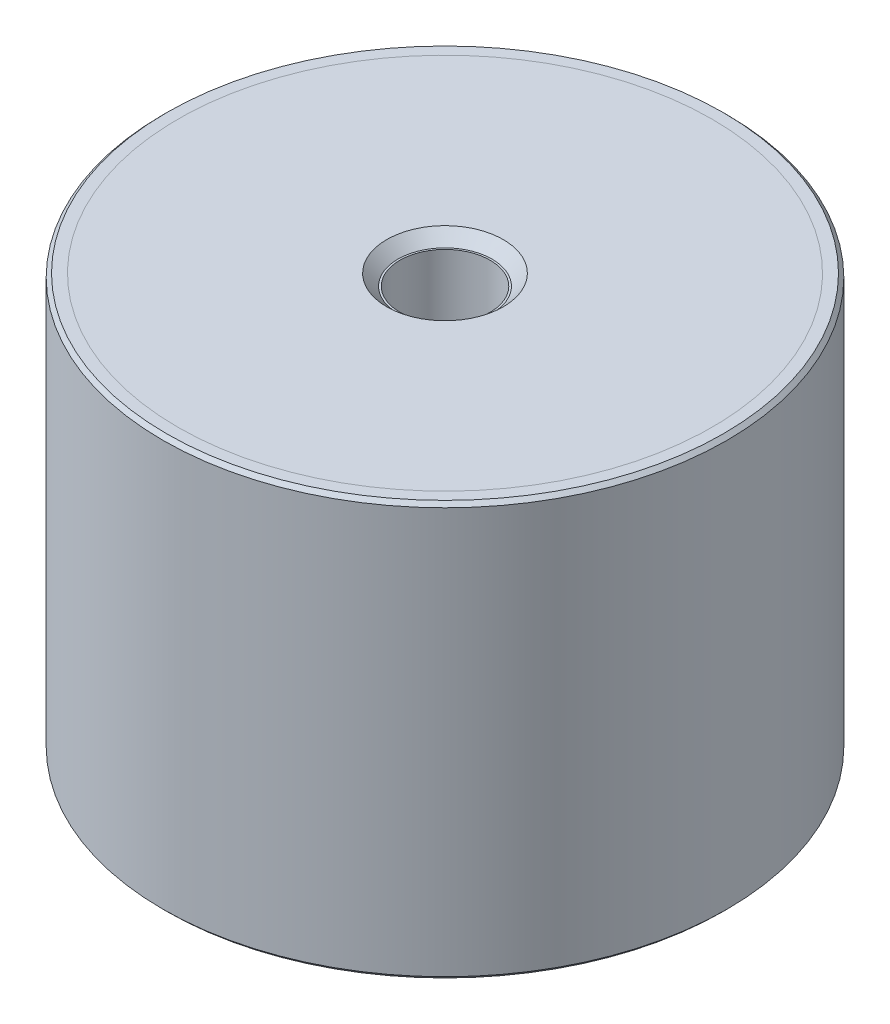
ISO-10303-21;
HEADER;
FILE_DESCRIPTION(('STEP AP214'),'2;1');
FILE_NAME('part.step','',(''),(''),'','','');
FILE_SCHEMA(('AUTOMOTIVE_DESIGN { 1 0 10303 214 1 1 1 1 }'));
ENDSEC;
DATA;
#1=APPLICATION_CONTEXT('core data for automotive mechanical design processes');
#2=APPLICATION_PROTOCOL_DEFINITION('international standard','automotive_design',2000,#1);
#3=PRODUCT_CONTEXT('',#1,'mechanical');
#4=PRODUCT('Part','Part','',(#3));
#5=PRODUCT_RELATED_PRODUCT_CATEGORY('part','',(#4));
#6=PRODUCT_DEFINITION_FORMATION('','',#4);
#7=PRODUCT_DEFINITION_CONTEXT('part definition',#1,'design');
#8=PRODUCT_DEFINITION('design','',#6,#7);
#9=PRODUCT_DEFINITION_SHAPE('','',#8);
#10=(LENGTH_UNIT() NAMED_UNIT(*) SI_UNIT(.MILLI.,.METRE.));
#11=(NAMED_UNIT(*) PLANE_ANGLE_UNIT() SI_UNIT($,.RADIAN.));
#12=(NAMED_UNIT(*) SI_UNIT($,.STERADIAN.) SOLID_ANGLE_UNIT());
#13=UNCERTAINTY_MEASURE_WITH_UNIT(LENGTH_MEASURE(1.E-05),#10,'distance_accuracy_value','');
#14=(GEOMETRIC_REPRESENTATION_CONTEXT(3) GLOBAL_UNCERTAINTY_ASSIGNED_CONTEXT((#13)) GLOBAL_UNIT_ASSIGNED_CONTEXT((#10,
#11,#12)) REPRESENTATION_CONTEXT('',''));
#15=CARTESIAN_POINT('',(0.,0.,0.));
#16=DIRECTION('',(0.,0.,1.));
#17=DIRECTION('',(1.,0.,0.));
#18=AXIS2_PLACEMENT_3D('',#15,#16,#17);
#19=CARTESIAN_POINT('',(0.,-52.,6.));
#20=DIRECTION('',(0.,1.,0.));
#21=DIRECTION('',(0.,0.,1.));
#22=AXIS2_PLACEMENT_3D('',#19,#20,#21);
#23=PLANE('',#22);
#24=CARTESIAN_POINT('',(0.,-52.,0.));
#25=DIRECTION('',(0.,1.,0.));
#26=DIRECTION('',(0.,0.,1.));
#27=AXIS2_PLACEMENT_3D('',#24,#25,#26);
#28=CIRCLE('',#27,6.25000000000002);
#29=CARTESIAN_POINT('',(0.,-52.,6.25000000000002));
#30=VERTEX_POINT('',#29);
#31=EDGE_CURVE('P0_E10',#30,#30,#28,.F.);
#32=ORIENTED_EDGE('',*,*,#31,.T.);
#33=EDGE_LOOP('',(#32));
#34=FACE_BOUND('',#33,.T.);
#35=CARTESIAN_POINT('',(0.,-52.,0.));
#36=DIRECTION('',(0.,1.,0.));
#37=DIRECTION('',(0.,0.,1.));
#38=AXIS2_PLACEMENT_3D('',#35,#36,#37);
#39=CIRCLE('',#38,35.5);
#40=CARTESIAN_POINT('',(0.,-52.,35.5));
#41=VERTEX_POINT('',#40);
#42=EDGE_CURVE('P0_E25',#41,#41,#39,.T.);
#43=ORIENTED_EDGE('',*,*,#42,.T.);
#44=EDGE_LOOP('',(#43));
#45=FACE_BOUND('',#44,.T.);
#46=ADVANCED_FACE('P0_F14',(#34,#45),#23,.T.);
#47=CARTESIAN_POINT('',(0.,16.0340428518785,0.));
#48=DIRECTION('',(0.,1.,0.));
#49=DIRECTION('',(0.,0.,1.));
#50=AXIS2_PLACEMENT_3D('',#47,#48,#49);
#51=CYLINDRICAL_SURFACE('',#50,35.5);
#52=CARTESIAN_POINT('',(0.,-53.5,0.));
#53=DIRECTION('',(0.,1.,0.));
#54=DIRECTION('',(0.,0.,1.));
#55=AXIS2_PLACEMENT_3D('',#52,#53,#54);
#56=CIRCLE('',#55,35.5);
#57=CARTESIAN_POINT('',(0.,-53.5,35.5));
#58=VERTEX_POINT('',#57);
#59=EDGE_CURVE('P0_E29',#58,#58,#56,.T.);
#60=ORIENTED_EDGE('',*,*,#59,.T.);
#61=EDGE_LOOP('',(#60));
#62=FACE_BOUND('',#61,.T.);
#63=ORIENTED_EDGE('',*,*,#42,.F.);
#64=EDGE_LOOP('',(#63));
#65=FACE_BOUND('',#64,.T.);
#66=ADVANCED_FACE('P0_F35',(#62,#65),#51,.T.);
#67=CARTESIAN_POINT('',(0.,-53.5,35.5));
#68=DIRECTION('',(0.,-1.,0.));
#69=DIRECTION('',(0.,0.,-1.));
#70=AXIS2_PLACEMENT_3D('',#67,#68,#69);
#71=PLANE('',#70);
#72=CARTESIAN_POINT('',(0.,-53.5,0.));
#73=DIRECTION('',(0.,-1.,0.));
#74=DIRECTION('',(0.,0.,-1.));
#75=AXIS2_PLACEMENT_3D('',#72,#73,#74);
#76=CIRCLE('',#75,7.75000000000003);
#77=CARTESIAN_POINT('',(0.,-53.5,-7.75000000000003));
#78=VERTEX_POINT('',#77);
#79=EDGE_CURVE('P0_E21',#78,#78,#76,.F.);
#80=ORIENTED_EDGE('',*,*,#79,.T.);
#81=EDGE_LOOP('',(#80));
#82=FACE_BOUND('',#81,.T.);
#83=ORIENTED_EDGE('',*,*,#59,.F.);
#84=EDGE_LOOP('',(#83));
#85=FACE_BOUND('',#84,.T.);
#86=ADVANCED_FACE('P0_F38',(#82,#85),#71,.T.);
#87=CARTESIAN_POINT('',(0.,-53.5,0.));
#88=DIRECTION('',(0.,-1.,0.));
#89=DIRECTION('',(0.,0.,-1.));
#90=AXIS2_PLACEMENT_3D('',#87,#88,#89);
#91=CONICAL_SURFACE('',#90,7.75000000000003,0.785398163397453);
#92=ORIENTED_EDGE('',*,*,#31,.F.);
#93=EDGE_LOOP('',(#92));
#94=FACE_BOUND('',#93,.T.);
#95=ORIENTED_EDGE('',*,*,#79,.F.);
#96=EDGE_LOOP('',(#95));
#97=FACE_BOUND('',#96,.T.);
#98=ADVANCED_FACE('P0_F16',(#94,#97),#91,.F.);
#99=CLOSED_SHELL('',(#46,#66,#86,#98));
#100=MANIFOLD_SOLID_BREP('P0_B1',#99);
#101=CARTESIAN_POINT('',(0.,1.5,6.));
#102=DIRECTION('',(0.,1.,0.));
#103=DIRECTION('',(0.,0.,1.));
#104=AXIS2_PLACEMENT_3D('',#101,#102,#103);
#105=PLANE('',#104);
#106=CARTESIAN_POINT('',(0.,1.5,0.));
#107=DIRECTION('',(0.,1.,0.));
#108=DIRECTION('',(0.,0.,1.));
#109=AXIS2_PLACEMENT_3D('',#106,#107,#108);
#110=CIRCLE('',#109,7.75000000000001);
#111=CARTESIAN_POINT('',(0.,1.5,7.75000000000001));
#112=VERTEX_POINT('',#111);
#113=EDGE_CURVE('P1_E10',#112,#112,#110,.F.);
#114=ORIENTED_EDGE('',*,*,#113,.T.);
#115=EDGE_LOOP('',(#114));
#116=FACE_BOUND('',#115,.T.);
#117=CARTESIAN_POINT('',(0.,1.5,0.));
#118=DIRECTION('',(0.,1.,0.));
#119=DIRECTION('',(0.,0.,1.));
#120=AXIS2_PLACEMENT_3D('',#117,#118,#119);
#121=CIRCLE('',#120,35.5);
#122=CARTESIAN_POINT('',(0.,1.5,35.5));
#123=VERTEX_POINT('',#122);
#124=EDGE_CURVE('P1_E25',#123,#123,#121,.T.);
#125=ORIENTED_EDGE('',*,*,#124,.T.);
#126=EDGE_LOOP('',(#125));
#127=FACE_BOUND('',#126,.T.);
#128=ADVANCED_FACE('P1_F14',(#116,#127),#105,.T.);
#129=CARTESIAN_POINT('',(0.,69.5340428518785,0.));
#130=DIRECTION('',(0.,1.,0.));
#131=DIRECTION('',(0.,0.,1.));
#132=AXIS2_PLACEMENT_3D('',#129,#130,#131);
#133=CYLINDRICAL_SURFACE('',#132,35.5);
#134=CARTESIAN_POINT('',(0.,0.,0.));
#135=DIRECTION('',(0.,1.,0.));
#136=DIRECTION('',(0.,0.,1.));
#137=AXIS2_PLACEMENT_3D('',#134,#135,#136);
#138=CIRCLE('',#137,35.5);
#139=CARTESIAN_POINT('',(0.,0.,35.5));
#140=VERTEX_POINT('',#139);
#141=EDGE_CURVE('P1_E29',#140,#140,#138,.T.);
#142=ORIENTED_EDGE('',*,*,#141,.T.);
#143=EDGE_LOOP('',(#142));
#144=FACE_BOUND('',#143,.T.);
#145=ORIENTED_EDGE('',*,*,#124,.F.);
#146=EDGE_LOOP('',(#145));
#147=FACE_BOUND('',#146,.T.);
#148=ADVANCED_FACE('P1_F35',(#144,#147),#133,.T.);
#149=CARTESIAN_POINT('',(0.,0.,35.5));
#150=DIRECTION('',(0.,-1.,0.));
#151=DIRECTION('',(0.,0.,-1.));
#152=AXIS2_PLACEMENT_3D('',#149,#150,#151);
#153=PLANE('',#152);
#154=CARTESIAN_POINT('',(0.,0.,0.));
#155=DIRECTION('',(0.,-1.,0.));
#156=DIRECTION('',(0.,0.,-1.));
#157=AXIS2_PLACEMENT_3D('',#154,#155,#156);
#158=CIRCLE('',#157,6.25000000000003);
#159=CARTESIAN_POINT('',(0.,0.,-6.25000000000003));
#160=VERTEX_POINT('',#159);
#161=EDGE_CURVE('P1_E21',#160,#160,#158,.F.);
#162=ORIENTED_EDGE('',*,*,#161,.T.);
#163=EDGE_LOOP('',(#162));
#164=FACE_BOUND('',#163,.T.);
#165=ORIENTED_EDGE('',*,*,#141,.F.);
#166=EDGE_LOOP('',(#165));
#167=FACE_BOUND('',#166,.T.);
#168=ADVANCED_FACE('P1_F38',(#164,#167),#153,.T.);
#169=CARTESIAN_POINT('',(0.,-0.250000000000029,0.));
#170=DIRECTION('',(0.,1.,0.));
#171=DIRECTION('',(0.,0.,1.));
#172=AXIS2_PLACEMENT_3D('',#169,#170,#171);
#173=CONICAL_SURFACE('',#172,6.,0.785398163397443);
#174=ORIENTED_EDGE('',*,*,#113,.F.);
#175=EDGE_LOOP('',(#174));
#176=FACE_BOUND('',#175,.T.);
#177=ORIENTED_EDGE('',*,*,#161,.F.);
#178=EDGE_LOOP('',(#177));
#179=FACE_BOUND('',#178,.T.);
#180=ADVANCED_FACE('P1_F16',(#176,#179),#173,.F.);
#181=CLOSED_SHELL('',(#128,#148,#168,#180));
#182=MANIFOLD_SOLID_BREP('P1_B1',#181);
#183=CARTESIAN_POINT('',(0.,0.,0.));
#184=DIRECTION('',(0.,1.,0.));
#185=DIRECTION('',(0.,0.,1.));
#186=AXIS2_PLACEMENT_3D('',#183,#184,#185);
#187=PLANE('',#186);
#188=CARTESIAN_POINT('',(0.,0.,0.));
#189=DIRECTION('',(0.,1.,0.));
#190=DIRECTION('',(0.,0.,1.));
#191=AXIS2_PLACEMENT_3D('',#188,#189,#190);
#192=CIRCLE('',#191,6.);
#193=CARTESIAN_POINT('',(0.,0.,6.));
#194=VERTEX_POINT('',#193);
#195=EDGE_CURVE('P2_E46',#194,#194,#192,.T.);
#196=ORIENTED_EDGE('',*,*,#195,.F.);
#197=EDGE_LOOP('',(#196));
#198=FACE_BOUND('',#197,.T.);
#199=CARTESIAN_POINT('',(0.,0.,0.));
#200=DIRECTION('',(0.,1.,0.));
#201=DIRECTION('',(0.,0.,1.));
#202=AXIS2_PLACEMENT_3D('',#199,#200,#201);
#203=CIRCLE('',#202,35.5);
#204=CARTESIAN_POINT('',(0.,0.,35.5));
#205=VERTEX_POINT('',#204);
#206=EDGE_CURVE('P2_E33',#205,#205,#203,.T.);
#207=ORIENTED_EDGE('',*,*,#206,.T.);
#208=EDGE_LOOP('',(#207));
#209=FACE_BOUND('',#208,.T.);
#210=ADVANCED_FACE('P2_F13',(#198,#209),#187,.T.);
#211=CARTESIAN_POINT('',(0.,65.5134936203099,0.));
#212=DIRECTION('',(0.,1.,0.));
#213=DIRECTION('',(0.,0.,1.));
#214=AXIS2_PLACEMENT_3D('',#211,#212,#213);
#215=CYLINDRICAL_SURFACE('',#214,35.5);
#216=CARTESIAN_POINT('',(0.,1.5,0.));
#217=DIRECTION('',(0.,1.,0.));
#218=DIRECTION('',(0.,0.,1.));
#219=AXIS2_PLACEMENT_3D('',#216,#217,#218);
#220=CIRCLE('',#219,35.5);
#221=CARTESIAN_POINT('',(0.,1.5,35.5));
#222=VERTEX_POINT('',#221);
#223=EDGE_CURVE('P2_E36',#222,#222,#220,.T.);
#224=ORIENTED_EDGE('',*,*,#223,.T.);
#225=EDGE_LOOP('',(#224));
#226=FACE_BOUND('',#225,.T.);
#227=ORIENTED_EDGE('',*,*,#206,.F.);
#228=EDGE_LOOP('',(#227));
#229=FACE_BOUND('',#228,.T.);
#230=ADVANCED_FACE('P2_F92',(#226,#229),#215,.F.);
#231=CARTESIAN_POINT('',(0.,1.5,35.5));
#232=DIRECTION('',(0.,1.,0.));
#233=DIRECTION('',(0.,0.,1.));
#234=AXIS2_PLACEMENT_3D('',#231,#232,#233);
#235=PLANE('',#234);
#236=CARTESIAN_POINT('',(0.,1.5,0.));
#237=DIRECTION('',(0.,1.,0.));
#238=DIRECTION('',(0.,0.,1.));
#239=AXIS2_PLACEMENT_3D('',#236,#237,#238);
#240=CIRCLE('',#239,37.);
#241=CARTESIAN_POINT('',(0.,1.5,37.));
#242=VERTEX_POINT('',#241);
#243=EDGE_CURVE('P2_E9',#242,#242,#240,.T.);
#244=ORIENTED_EDGE('',*,*,#243,.T.);
#245=EDGE_LOOP('',(#244));
#246=FACE_BOUND('',#245,.T.);
#247=ORIENTED_EDGE('',*,*,#223,.F.);
#248=EDGE_LOOP('',(#247));
#249=FACE_BOUND('',#248,.T.);
#250=ADVANCED_FACE('P2_F88',(#246,#249),#235,.T.);
#251=CARTESIAN_POINT('',(0.,65.5134936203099,0.));
#252=DIRECTION('',(0.,1.,0.));
#253=DIRECTION('',(0.,0.,1.));
#254=AXIS2_PLACEMENT_3D('',#251,#252,#253);
#255=CYLINDRICAL_SURFACE('',#254,37.5);
#256=CARTESIAN_POINT('',(0.,-53.,0.));
#257=DIRECTION('',(0.,-1.,0.));
#258=DIRECTION('',(0.,0.,-1.));
#259=AXIS2_PLACEMENT_3D('',#256,#257,#258);
#260=CIRCLE('',#259,37.5);
#261=CARTESIAN_POINT('',(0.,-53.,-37.5));
#262=VERTEX_POINT('',#261);
#263=EDGE_CURVE('P2_E24',#262,#262,#260,.F.);
#264=ORIENTED_EDGE('',*,*,#263,.T.);
#265=EDGE_LOOP('',(#264));
#266=FACE_BOUND('',#265,.T.);
#267=CARTESIAN_POINT('',(0.,1.,0.));
#268=DIRECTION('',(0.,1.,0.));
#269=DIRECTION('',(0.,0.,1.));
#270=AXIS2_PLACEMENT_3D('',#267,#268,#269);
#271=CIRCLE('',#270,37.5);
#272=CARTESIAN_POINT('',(0.,1.,37.5));
#273=VERTEX_POINT('',#272);
#274=EDGE_CURVE('P2_E28',#273,#273,#271,.F.);
#275=ORIENTED_EDGE('',*,*,#274,.T.);
#276=EDGE_LOOP('',(#275));
#277=FACE_BOUND('',#276,.T.);
#278=ADVANCED_FACE('P2_F82',(#266,#277),#255,.T.);
#279=CARTESIAN_POINT('',(0.,-53.5,37.5));
#280=DIRECTION('',(0.,-1.,0.));
#281=DIRECTION('',(0.,0.,-1.));
#282=AXIS2_PLACEMENT_3D('',#279,#280,#281);
#283=PLANE('',#282);
#284=CARTESIAN_POINT('',(0.,-53.5,0.));
#285=DIRECTION('',(0.,-1.,0.));
#286=DIRECTION('',(0.,0.,-1.));
#287=AXIS2_PLACEMENT_3D('',#284,#285,#286);
#288=CIRCLE('',#287,37.);
#289=CARTESIAN_POINT('',(0.,-53.5,-37.));
#290=VERTEX_POINT('',#289);
#291=EDGE_CURVE('P2_E20',#290,#290,#288,.T.);
#292=ORIENTED_EDGE('',*,*,#291,.T.);
#293=EDGE_LOOP('',(#292));
#294=FACE_BOUND('',#293,.T.);
#295=CARTESIAN_POINT('',(0.,-53.5,0.));
#296=DIRECTION('',(0.,1.,0.));
#297=DIRECTION('',(0.,0.,1.));
#298=AXIS2_PLACEMENT_3D('',#295,#296,#297);
#299=CIRCLE('',#298,35.5);
#300=CARTESIAN_POINT('',(0.,-53.5,35.5));
#301=VERTEX_POINT('',#300);
#302=EDGE_CURVE('P2_E39',#301,#301,#299,.T.);
#303=ORIENTED_EDGE('',*,*,#302,.T.);
#304=EDGE_LOOP('',(#303));
#305=FACE_BOUND('',#304,.T.);
#306=ADVANCED_FACE('P2_F77',(#294,#305),#283,.T.);
#307=CARTESIAN_POINT('',(0.,65.5134936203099,0.));
#308=DIRECTION('',(0.,1.,0.));
#309=DIRECTION('',(0.,0.,1.));
#310=AXIS2_PLACEMENT_3D('',#307,#308,#309);
#311=CYLINDRICAL_SURFACE('',#310,35.5);
#312=CARTESIAN_POINT('',(0.,-52.,0.));
#313=DIRECTION('',(0.,1.,0.));
#314=DIRECTION('',(0.,0.,1.));
#315=AXIS2_PLACEMENT_3D('',#312,#313,#314);
#316=CIRCLE('',#315,35.5);
#317=CARTESIAN_POINT('',(0.,-52.,35.5));
#318=VERTEX_POINT('',#317);
#319=EDGE_CURVE('P2_E42',#318,#318,#316,.T.);
#320=ORIENTED_EDGE('',*,*,#319,.T.);
#321=EDGE_LOOP('',(#320));
#322=FACE_BOUND('',#321,.T.);
#323=ORIENTED_EDGE('',*,*,#302,.F.);
#324=EDGE_LOOP('',(#323));
#325=FACE_BOUND('',#324,.T.);
#326=ADVANCED_FACE('P2_F71',(#322,#325),#311,.F.);
#327=CARTESIAN_POINT('',(0.,-52.,35.5));
#328=DIRECTION('',(0.,-1.,0.));
#329=DIRECTION('',(0.,0.,-1.));
#330=AXIS2_PLACEMENT_3D('',#327,#328,#329);
#331=PLANE('',#330);
#332=CARTESIAN_POINT('',(0.,-52.,0.));
#333=DIRECTION('',(0.,-1.,0.));
#334=DIRECTION('',(0.,0.,-1.));
#335=AXIS2_PLACEMENT_3D('',#332,#333,#334);
#336=CIRCLE('',#335,6.);
#337=CARTESIAN_POINT('',(0.,-52.,-6.));
#338=VERTEX_POINT('',#337);
#339=EDGE_CURVE('P2_E52',#338,#338,#336,.T.);
#340=ORIENTED_EDGE('',*,*,#339,.F.);
#341=EDGE_LOOP('',(#340));
#342=FACE_BOUND('',#341,.T.);
#343=ORIENTED_EDGE('',*,*,#319,.F.);
#344=EDGE_LOOP('',(#343));
#345=FACE_BOUND('',#344,.T.);
#346=ADVANCED_FACE('P2_F67',(#342,#345),#331,.T.);
#347=CARTESIAN_POINT('',(0.,-53.,0.));
#348=DIRECTION('',(0.,1.,0.));
#349=DIRECTION('',(0.,0.,1.));
#350=AXIS2_PLACEMENT_3D('',#347,#348,#349);
#351=CONICAL_SURFACE('',#350,37.5,0.785398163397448);
#352=ORIENTED_EDGE('',*,*,#291,.F.);
#353=EDGE_LOOP('',(#352));
#354=FACE_BOUND('',#353,.T.);
#355=ORIENTED_EDGE('',*,*,#263,.F.);
#356=EDGE_LOOP('',(#355));
#357=FACE_BOUND('',#356,.T.);
#358=ADVANCED_FACE('P2_F70',(#354,#357),#351,.T.);
#359=CARTESIAN_POINT('',(0.,1.5,0.));
#360=DIRECTION('',(0.,-1.,0.));
#361=DIRECTION('',(0.,0.,-1.));
#362=AXIS2_PLACEMENT_3D('',#359,#360,#361);
#363=CONICAL_SURFACE('',#362,37.,0.785398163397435);
#364=ORIENTED_EDGE('',*,*,#274,.F.);
#365=EDGE_LOOP('',(#364));
#366=FACE_BOUND('',#365,.T.);
#367=ORIENTED_EDGE('',*,*,#243,.F.);
#368=EDGE_LOOP('',(#367));
#369=FACE_BOUND('',#368,.T.);
#370=ADVANCED_FACE('P2_F15',(#366,#369),#363,.T.);
#371=CARTESIAN_POINT('',(0.,-10.5,0.));
#372=DIRECTION('',(0.,1.,0.));
#373=DIRECTION('',(0.,0.,1.));
#374=AXIS2_PLACEMENT_3D('',#371,#372,#373);
#375=CYLINDRICAL_SURFACE('',#374,6.);
#376=CARTESIAN_POINT('',(0.,-10.5,0.));
#377=DIRECTION('',(0.,1.,0.));
#378=DIRECTION('',(0.,0.,1.));
#379=AXIS2_PLACEMENT_3D('',#376,#377,#378);
#380=CIRCLE('',#379,6.);
#381=CARTESIAN_POINT('',(0.,-10.5,6.));
#382=VERTEX_POINT('',#381);
#383=EDGE_CURVE('P2_E45',#382,#382,#380,.T.);
#384=CARTESIAN_POINT('',(0.,-10.5,6.));
#385=CARTESIAN_POINT('',(0.,-10.390625,6.));
#386=CARTESIAN_POINT('',(0.,-10.28125,6.));
#387=CARTESIAN_POINT('',(0.,-10.0625,6.));
#388=CARTESIAN_POINT('',(0.,-9.953125,6.));
#389=CARTESIAN_POINT('',(0.,-9.734375,6.));
#390=CARTESIAN_POINT('',(0.,-9.625,6.));
#391=CARTESIAN_POINT('',(0.,-9.40625,6.));
#392=CARTESIAN_POINT('',(0.,-9.296875,6.));
#393=CARTESIAN_POINT('',(0.,-9.078125,6.));
#394=CARTESIAN_POINT('',(0.,-8.96875,6.));
#395=CARTESIAN_POINT('',(0.,-8.75,6.));
#396=CARTESIAN_POINT('',(0.,-8.640625,6.));
#397=CARTESIAN_POINT('',(0.,-8.421875,6.));
#398=CARTESIAN_POINT('',(0.,-8.3125,6.));
#399=CARTESIAN_POINT('',(0.,-8.09375,6.));
#400=CARTESIAN_POINT('',(0.,-7.984375,6.));
#401=CARTESIAN_POINT('',(0.,-7.765625,6.));
#402=CARTESIAN_POINT('',(0.,-7.65625,6.));
#403=CARTESIAN_POINT('',(0.,-7.4375,6.));
#404=CARTESIAN_POINT('',(0.,-7.328125,6.));
#405=CARTESIAN_POINT('',(0.,-7.109375,6.));
#406=CARTESIAN_POINT('',(0.,-7.,6.));
#407=CARTESIAN_POINT('',(0.,-6.78125,6.));
#408=CARTESIAN_POINT('',(0.,-6.671875,6.));
#409=CARTESIAN_POINT('',(0.,-6.453125,6.));
#410=CARTESIAN_POINT('',(0.,-6.34375,6.));
#411=CARTESIAN_POINT('',(0.,-6.125,6.));
#412=CARTESIAN_POINT('',(0.,-6.015625,6.));
#413=CARTESIAN_POINT('',(0.,-5.796875,6.));
#414=CARTESIAN_POINT('',(0.,-5.6875,6.));
#415=CARTESIAN_POINT('',(0.,-5.46875,6.));
#416=CARTESIAN_POINT('',(0.,-5.359375,6.));
#417=CARTESIAN_POINT('',(0.,-5.140625,6.));
#418=CARTESIAN_POINT('',(0.,-5.03125,6.));
#419=CARTESIAN_POINT('',(0.,-4.8125,6.));
#420=CARTESIAN_POINT('',(0.,-4.703125,6.));
#421=CARTESIAN_POINT('',(0.,-4.484375,6.));
#422=CARTESIAN_POINT('',(0.,-4.375,6.));
#423=CARTESIAN_POINT('',(0.,-4.15625,6.));
#424=CARTESIAN_POINT('',(0.,-4.046875,6.));
#425=CARTESIAN_POINT('',(0.,-3.828125,6.));
#426=CARTESIAN_POINT('',(0.,-3.71875,6.));
#427=CARTESIAN_POINT('',(0.,-3.5,6.));
#428=CARTESIAN_POINT('',(0.,-3.390625,6.));
#429=CARTESIAN_POINT('',(0.,-3.171875,6.));
#430=CARTESIAN_POINT('',(0.,-3.0625,6.));
#431=CARTESIAN_POINT('',(0.,-2.84375,6.));
#432=CARTESIAN_POINT('',(0.,-2.734375,6.));
#433=CARTESIAN_POINT('',(0.,-2.515625,6.));
#434=CARTESIAN_POINT('',(0.,-2.40625,6.));
#435=CARTESIAN_POINT('',(0.,-2.1875,6.));
#436=CARTESIAN_POINT('',(0.,-2.078125,6.));
#437=CARTESIAN_POINT('',(0.,-1.859375,6.));
#438=CARTESIAN_POINT('',(0.,-1.75,6.));
#439=CARTESIAN_POINT('',(0.,-1.53125,6.));
#440=CARTESIAN_POINT('',(0.,-1.421875,6.));
#441=CARTESIAN_POINT('',(0.,-1.203125,6.));
#442=CARTESIAN_POINT('',(0.,-1.09375,6.));
#443=CARTESIAN_POINT('',(0.,-0.875000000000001,6.));
#444=CARTESIAN_POINT('',(0.,-0.765625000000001,6.));
#445=CARTESIAN_POINT('',(0.,-0.546875,6.));
#446=CARTESIAN_POINT('',(0.,-0.4375,6.));
#447=CARTESIAN_POINT('',(0.,-0.21875,6.));
#448=CARTESIAN_POINT('',(0.,-0.109375,6.));
#449=CARTESIAN_POINT('',(0.,0.,6.));
#450=B_SPLINE_CURVE_WITH_KNOTS('',3,(#384,#385,#386,#387,#388,#389,#390,#391,#392,#393,#394,
#395,#396,#397,#398,#399,#400,#401,#402,#403,#404,#405,#406,#407,#408,#409,#410,#411,#412,#413,
#414,#415,#416,#417,#418,#419,#420,#421,#422,#423,#424,#425,#426,#427,#428,#429,#430,#431,#432,
#433,#434,#435,#436,#437,#438,#439,#440,#441,#442,#443,#444,#445,#446,#447,#448,#449),
.UNSPECIFIED.,.F.,.F.,(4,2,2,2,2,2,2,2,2,2,2,2,2,2,2,2,2,2,2,2,2,2,2,2,2,2,2,2,2,2,2,2,4),(0.,
0.328124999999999,0.656249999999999,0.984374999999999,1.3125,1.640625,1.96875,2.296875,2.625,
2.953125,3.28125,3.609375,3.9375,4.265625,4.59375,4.921875,5.25,5.578125,5.90625,6.234375,
6.5625,6.890625,7.21875,7.546875,7.875,8.203125,8.53125,8.859375,9.1875,9.515625,9.84375,
10.171875,10.5),.UNSPECIFIED.);
#451=EDGE_CURVE('P2_BSEAM108',#382,#194,#450,.T.);
#452=ORIENTED_EDGE('',*,*,#383,.F.);
#453=ORIENTED_EDGE('',*,*,#195,.T.);
#454=ORIENTED_EDGE('',*,*,#451,.T.);
#455=ORIENTED_EDGE('',*,*,#451,.F.);
#456=EDGE_LOOP('',(#452,#454,#453,#455));
#457=FACE_BOUND('',#456,.T.);
#458=ADVANCED_FACE('P2_F108',(#457),#375,.F.);
#459=CARTESIAN_POINT('',(0.,-10.5,0.));
#460=DIRECTION('',(0.,1.,0.));
#461=DIRECTION('',(0.,0.,1.));
#462=AXIS2_PLACEMENT_3D('',#459,#460,#461);
#463=PLANE('',#462);
#464=ORIENTED_EDGE('',*,*,#383,.T.);
#465=EDGE_LOOP('',(#464));
#466=FACE_BOUND('',#465,.T.);
#467=ADVANCED_FACE('P2_F63',(#466),#463,.T.);
#468=CARTESIAN_POINT('',(0.,-41.5,0.));
#469=DIRECTION('',(0.,-1.,0.));
#470=DIRECTION('',(0.,0.,-1.));
#471=AXIS2_PLACEMENT_3D('',#468,#469,#470);
#472=CYLINDRICAL_SURFACE('',#471,6.);
#473=CARTESIAN_POINT('',(0.,-41.5,0.));
#474=DIRECTION('',(0.,-1.,0.));
#475=DIRECTION('',(0.,0.,-1.));
#476=AXIS2_PLACEMENT_3D('',#473,#474,#475);
#477=CIRCLE('',#476,6.);
#478=CARTESIAN_POINT('',(0.,-41.5,-6.));
#479=VERTEX_POINT('',#478);
#480=EDGE_CURVE('P2_E49',#479,#479,#477,.T.);
#481=CARTESIAN_POINT('',(0.,-41.5,-6.));
#482=CARTESIAN_POINT('',(0.,-41.609375,-6.));
#483=CARTESIAN_POINT('',(0.,-41.71875,-6.));
#484=CARTESIAN_POINT('',(0.,-41.9375,-6.));
#485=CARTESIAN_POINT('',(0.,-42.046875,-6.));
#486=CARTESIAN_POINT('',(0.,-42.265625,-6.));
#487=CARTESIAN_POINT('',(0.,-42.375,-6.));
#488=CARTESIAN_POINT('',(0.,-42.59375,-6.));
#489=CARTESIAN_POINT('',(0.,-42.703125,-6.));
#490=CARTESIAN_POINT('',(0.,-42.921875,-6.));
#491=CARTESIAN_POINT('',(0.,-43.03125,-6.));
#492=CARTESIAN_POINT('',(0.,-43.25,-6.));
#493=CARTESIAN_POINT('',(0.,-43.359375,-6.));
#494=CARTESIAN_POINT('',(0.,-43.578125,-6.));
#495=CARTESIAN_POINT('',(0.,-43.6875,-6.));
#496=CARTESIAN_POINT('',(0.,-43.90625,-6.));
#497=CARTESIAN_POINT('',(0.,-44.015625,-6.));
#498=CARTESIAN_POINT('',(0.,-44.234375,-6.));
#499=CARTESIAN_POINT('',(0.,-44.34375,-6.));
#500=CARTESIAN_POINT('',(0.,-44.5625,-6.));
#501=CARTESIAN_POINT('',(0.,-44.671875,-6.));
#502=CARTESIAN_POINT('',(0.,-44.890625,-6.));
#503=CARTESIAN_POINT('',(0.,-45.,-6.));
#504=CARTESIAN_POINT('',(0.,-45.21875,-6.));
#505=CARTESIAN_POINT('',(0.,-45.328125,-6.));
#506=CARTESIAN_POINT('',(0.,-45.546875,-6.));
#507=CARTESIAN_POINT('',(0.,-45.65625,-6.));
#508=CARTESIAN_POINT('',(0.,-45.875,-6.));
#509=CARTESIAN_POINT('',(0.,-45.984375,-6.));
#510=CARTESIAN_POINT('',(0.,-46.203125,-6.));
#511=CARTESIAN_POINT('',(0.,-46.3125,-6.));
#512=CARTESIAN_POINT('',(0.,-46.53125,-6.));
#513=CARTESIAN_POINT('',(0.,-46.640625,-6.));
#514=CARTESIAN_POINT('',(0.,-46.859375,-6.));
#515=CARTESIAN_POINT('',(0.,-46.96875,-6.));
#516=CARTESIAN_POINT('',(0.,-47.1875,-6.));
#517=CARTESIAN_POINT('',(0.,-47.296875,-6.));
#518=CARTESIAN_POINT('',(0.,-47.515625,-6.));
#519=CARTESIAN_POINT('',(0.,-47.625,-6.));
#520=CARTESIAN_POINT('',(0.,-47.84375,-6.));
#521=CARTESIAN_POINT('',(0.,-47.953125,-6.));
#522=CARTESIAN_POINT('',(0.,-48.171875,-6.));
#523=CARTESIAN_POINT('',(0.,-48.28125,-6.));
#524=CARTESIAN_POINT('',(0.,-48.5,-6.));
#525=CARTESIAN_POINT('',(0.,-48.609375,-6.));
#526=CARTESIAN_POINT('',(0.,-48.828125,-6.));
#527=CARTESIAN_POINT('',(0.,-48.9375,-6.));
#528=CARTESIAN_POINT('',(0.,-49.15625,-6.));
#529=CARTESIAN_POINT('',(0.,-49.265625,-6.));
#530=CARTESIAN_POINT('',(0.,-49.484375,-6.));
#531=CARTESIAN_POINT('',(0.,-49.59375,-6.));
#532=CARTESIAN_POINT('',(0.,-49.8125,-6.));
#533=CARTESIAN_POINT('',(0.,-49.921875,-6.));
#534=CARTESIAN_POINT('',(0.,-50.140625,-6.));
#535=CARTESIAN_POINT('',(0.,-50.25,-6.));
#536=CARTESIAN_POINT('',(0.,-50.46875,-6.));
#537=CARTESIAN_POINT('',(0.,-50.578125,-6.));
#538=CARTESIAN_POINT('',(0.,-50.796875,-6.));
#539=CARTESIAN_POINT('',(0.,-50.90625,-6.));
#540=CARTESIAN_POINT('',(0.,-51.125,-6.));
#541=CARTESIAN_POINT('',(0.,-51.234375,-6.));
#542=CARTESIAN_POINT('',(0.,-51.453125,-6.));
#543=CARTESIAN_POINT('',(0.,-51.5625,-6.));
#544=CARTESIAN_POINT('',(0.,-51.78125,-6.));
#545=CARTESIAN_POINT('',(0.,-51.890625,-6.));
#546=CARTESIAN_POINT('',(0.,-52.,-6.));
#547=B_SPLINE_CURVE_WITH_KNOTS('',3,(#481,#482,#483,#484,#485,#486,#487,#488,#489,#490,#491,
#492,#493,#494,#495,#496,#497,#498,#499,#500,#501,#502,#503,#504,#505,#506,#507,#508,#509,#510,
#511,#512,#513,#514,#515,#516,#517,#518,#519,#520,#521,#522,#523,#524,#525,#526,#527,#528,#529,
#530,#531,#532,#533,#534,#535,#536,#537,#538,#539,#540,#541,#542,#543,#544,#545,#546),
.UNSPECIFIED.,.F.,.F.,(4,2,2,2,2,2,2,2,2,2,2,2,2,2,2,2,2,2,2,2,2,2,2,2,2,2,2,2,2,2,2,2,4),(0.,
0.328124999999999,0.656249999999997,0.984374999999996,1.31249999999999,1.640625,1.96875,
2.296875,2.625,2.95312499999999,3.28125,3.609375,3.9375,4.26562499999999,4.59374999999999,
4.921875,5.25,5.578125,5.90624999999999,6.23437499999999,6.5625,6.890625,7.21875,
7.54687499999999,7.875,8.203125,8.53125,8.859375,9.18749999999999,9.51562499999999,9.84375,
10.171875,10.5),.UNSPECIFIED.);
#548=EDGE_CURVE('P2_BSEAM60',#479,#338,#547,.T.);
#549=ORIENTED_EDGE('',*,*,#480,.F.);
#550=ORIENTED_EDGE('',*,*,#339,.T.);
#551=ORIENTED_EDGE('',*,*,#548,.T.);
#552=ORIENTED_EDGE('',*,*,#548,.F.);
#553=EDGE_LOOP('',(#549,#551,#550,#552));
#554=FACE_BOUND('',#553,.T.);
#555=ADVANCED_FACE('P2_F60',(#554),#472,.F.);
#556=CARTESIAN_POINT('',(0.,-41.5,0.));
#557=DIRECTION('',(0.,-1.,0.));
#558=DIRECTION('',(0.,0.,-1.));
#559=AXIS2_PLACEMENT_3D('',#556,#557,#558);
#560=PLANE('',#559);
#561=ORIENTED_EDGE('',*,*,#480,.T.);
#562=EDGE_LOOP('',(#561));
#563=FACE_BOUND('',#562,.T.);
#564=ADVANCED_FACE('P2_F58',(#563),#560,.T.);
#565=CLOSED_SHELL('',(#210,#230,#250,#278,#306,#326,#346,#358,#370,#458,#467,#555,#564));
#566=MANIFOLD_SOLID_BREP('P2_B1',#565);
#567=ADVANCED_BREP_SHAPE_REPRESENTATION('',(#18,#100,#182,#566),#14);
#568=SHAPE_DEFINITION_REPRESENTATION(#9,#567);
ENDSEC;
END-ISO-10303-21;
